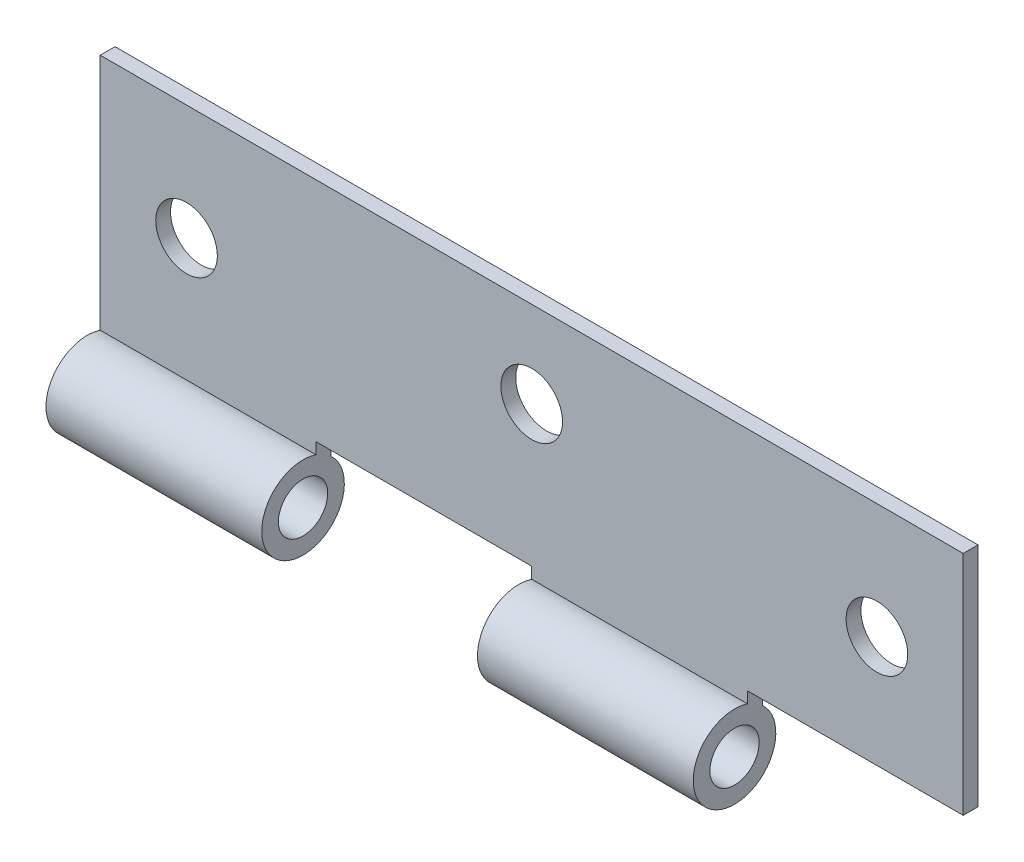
ISO-10303-21;
HEADER;
FILE_DESCRIPTION(('STEP AP214'),'2;1');
FILE_NAME('part.step','',(''),(''),'','','');
FILE_SCHEMA(('AUTOMOTIVE_DESIGN { 1 0 10303 214 1 1 1 1 }'));
ENDSEC;
DATA;
#1=APPLICATION_CONTEXT('core data for automotive mechanical design processes');
#2=APPLICATION_PROTOCOL_DEFINITION('international standard','automotive_design',2000,#1);
#3=PRODUCT_CONTEXT('',#1,'mechanical');
#4=PRODUCT('Part','Part','',(#3));
#5=PRODUCT_RELATED_PRODUCT_CATEGORY('part','',(#4));
#6=PRODUCT_DEFINITION_FORMATION('','',#4);
#7=PRODUCT_DEFINITION_CONTEXT('part definition',#1,'design');
#8=PRODUCT_DEFINITION('design','',#6,#7);
#9=PRODUCT_DEFINITION_SHAPE('','',#8);
#10=(LENGTH_UNIT() NAMED_UNIT(*) SI_UNIT(.MILLI.,.METRE.));
#11=(NAMED_UNIT(*) PLANE_ANGLE_UNIT() SI_UNIT($,.RADIAN.));
#12=(NAMED_UNIT(*) SI_UNIT($,.STERADIAN.) SOLID_ANGLE_UNIT());
#13=UNCERTAINTY_MEASURE_WITH_UNIT(LENGTH_MEASURE(1.E-05),#10,'distance_accuracy_value','');
#14=(GEOMETRIC_REPRESENTATION_CONTEXT(3) GLOBAL_UNCERTAINTY_ASSIGNED_CONTEXT((#13)) GLOBAL_UNIT_ASSIGNED_CONTEXT((#10,
#11,#12)) REPRESENTATION_CONTEXT('',''));
#15=CARTESIAN_POINT('',(0.,0.,0.));
#16=DIRECTION('',(0.,0.,1.));
#17=DIRECTION('',(1.,0.,0.));
#18=AXIS2_PLACEMENT_3D('',#15,#16,#17);
#19=CARTESIAN_POINT('',(35.,3.85,2.25));
#20=DIRECTION('',(-1.,0.,0.));
#21=DIRECTION('',(0.,0.,1.));
#22=AXIS2_PLACEMENT_3D('',#19,#20,#21);
#23=CYLINDRICAL_SURFACE('',#22,3.35);
#24=DIRECTION('',(-1.,0.,0.));
#25=VECTOR('',#24,1.);
#26=CARTESIAN_POINT('',(35.,7.03119474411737,1.2));
#27=LINE('',#26,#25);
#28=CARTESIAN_POINT('',(17.5,7.03119474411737,1.2));
#29=VERTEX_POINT('',#28);
#30=CARTESIAN_POINT('',(0.,7.03119474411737,1.2));
#31=VERTEX_POINT('',#30);
#32=EDGE_CURVE('E179',#29,#31,#27,.T.);
#33=ORIENTED_EDGE('',*,*,#32,.T.);
#34=CARTESIAN_POINT('',(0.,3.85,2.25));
#35=DIRECTION('',(1.,0.,0.));
#36=DIRECTION('',(0.,0.,-1.));
#37=AXIS2_PLACEMENT_3D('',#34,#35,#36);
#38=CIRCLE('',#37,3.35);
#39=CARTESIAN_POINT('',(0.,6.33193472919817,0.));
#40=VERTEX_POINT('',#39);
#41=EDGE_CURVE('E133',#31,#40,#38,.T.);
#42=ORIENTED_EDGE('',*,*,#41,.T.);
#43=DIRECTION('',(-1.,0.,0.));
#44=VECTOR('',#43,1.);
#45=CARTESIAN_POINT('',(35.,6.33193472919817,0.));
#46=LINE('',#45,#44);
#47=CARTESIAN_POINT('',(17.5,6.33193472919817,0.));
#48=VERTEX_POINT('',#47);
#49=EDGE_CURVE('E183',#48,#40,#46,.T.);
#50=ORIENTED_EDGE('',*,*,#49,.F.);
#51=CARTESIAN_POINT('',(17.5,3.85,2.25));
#52=DIRECTION('',(-1.,0.,0.));
#53=DIRECTION('',(0.,-1.,0.));
#54=AXIS2_PLACEMENT_3D('',#51,#52,#53);
#55=CIRCLE('',#54,3.35);
#56=EDGE_CURVE('E143',#48,#29,#55,.T.);
#57=ORIENTED_EDGE('',*,*,#56,.T.);
#58=EDGE_LOOP('',(#33,#42,#50,#57));
#59=FACE_BOUND('',#58,.T.);
#60=ADVANCED_FACE('F34',(#59),#23,.T.);
#61=CARTESIAN_POINT('',(35.,3.85,2.25));
#62=DIRECTION('',(-1.,0.,0.));
#63=DIRECTION('',(0.,0.,1.));
#64=AXIS2_PLACEMENT_3D('',#61,#62,#63);
#65=CYLINDRICAL_SURFACE('',#64,2.);
#66=CARTESIAN_POINT('',(0.,3.85,2.25));
#67=DIRECTION('',(1.,0.,0.));
#68=DIRECTION('',(0.,0.,-1.));
#69=AXIS2_PLACEMENT_3D('',#66,#67,#68);
#70=CIRCLE('',#69,2.);
#71=CARTESIAN_POINT('',(0.,3.85,0.249999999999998));
#72=VERTEX_POINT('',#71);
#73=EDGE_CURVE('E121',#72,#72,#70,.T.);
#74=ORIENTED_EDGE('',*,*,#73,.F.);
#75=EDGE_LOOP('',(#74));
#76=FACE_BOUND('',#75,.T.);
#77=CARTESIAN_POINT('',(17.5,3.85,2.25));
#78=DIRECTION('',(-1.,0.,0.));
#79=DIRECTION('',(0.,-1.,0.));
#80=AXIS2_PLACEMENT_3D('',#77,#78,#79);
#81=CIRCLE('',#80,2.);
#82=CARTESIAN_POINT('',(17.5,1.85,2.25));
#83=VERTEX_POINT('',#82);
#84=EDGE_CURVE('E138',#83,#83,#81,.T.);
#85=ORIENTED_EDGE('',*,*,#84,.F.);
#86=EDGE_LOOP('',(#85));
#87=FACE_BOUND('',#86,.T.);
#88=ADVANCED_FACE('F271',(#76,#87),#65,.F.);
#89=CARTESIAN_POINT('',(35.,3.85,2.25));
#90=DIRECTION('',(1.,0.,0.));
#91=DIRECTION('',(0.,0.,-1.));
#92=AXIS2_PLACEMENT_3D('',#89,#90,#91);
#93=PLANE('',#92);
#94=DIRECTION('',(0.,0.,1.));
#95=VECTOR('',#94,1.);
#96=CARTESIAN_POINT('',(35.,7.95,-1.25));
#97=LINE('',#96,#95);
#98=CARTESIAN_POINT('',(35.,7.95,0.));
#99=VERTEX_POINT('',#98);
#100=CARTESIAN_POINT('',(35.,7.95,1.2));
#101=VERTEX_POINT('',#100);
#102=EDGE_CURVE('E57',#99,#101,#97,.T.);
#103=ORIENTED_EDGE('',*,*,#102,.F.);
#104=DIRECTION('',(0.,-1.,0.));
#105=VECTOR('',#104,1.);
#106=CARTESIAN_POINT('',(35.,6.33193472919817,0.));
#107=LINE('',#106,#105);
#108=CARTESIAN_POINT('',(35.,26.35,0.));
#109=VERTEX_POINT('',#108);
#110=EDGE_CURVE('E155',#109,#99,#107,.T.);
#111=ORIENTED_EDGE('',*,*,#110,.F.);
#112=DIRECTION('',(0.,0.,-1.));
#113=VECTOR('',#112,1.);
#114=CARTESIAN_POINT('',(35.,26.35,1.2));
#115=LINE('',#114,#113);
#116=CARTESIAN_POINT('',(35.,26.35,1.2));
#117=VERTEX_POINT('',#116);
#118=EDGE_CURVE('E161',#117,#109,#115,.T.);
#119=ORIENTED_EDGE('',*,*,#118,.F.);
#120=DIRECTION('',(0.,1.,0.));
#121=VECTOR('',#120,1.);
#122=CARTESIAN_POINT('',(35.,7.03119474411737,1.2));
#123=LINE('',#122,#121);
#124=EDGE_CURVE('E158',#101,#117,#123,.T.);
#125=ORIENTED_EDGE('',*,*,#124,.F.);
#126=EDGE_LOOP('',(#103,#111,#119,#125));
#127=FACE_BOUND('',#126,.T.);
#128=ADVANCED_FACE('F249',(#127),#93,.T.);
#129=CARTESIAN_POINT('',(-35.,3.85,2.25));
#130=DIRECTION('',(1.,0.,0.));
#131=DIRECTION('',(0.,0.,-1.));
#132=AXIS2_PLACEMENT_3D('',#129,#130,#131);
#133=PLANE('',#132);
#134=DIRECTION('',(0.,-1.,0.));
#135=VECTOR('',#134,1.);
#136=CARTESIAN_POINT('',(-35.,6.33193472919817,0.));
#137=LINE('',#136,#135);
#138=CARTESIAN_POINT('',(-35.,26.35,0.));
#139=VERTEX_POINT('',#138);
#140=CARTESIAN_POINT('',(-35.,6.33193472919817,0.));
#141=VERTEX_POINT('',#140);
#142=EDGE_CURVE('E154',#139,#141,#137,.T.);
#143=ORIENTED_EDGE('',*,*,#142,.T.);
#144=CARTESIAN_POINT('',(-35.,3.85,2.25));
#145=DIRECTION('',(-1.,0.,0.));
#146=DIRECTION('',(0.,0.,-1.));
#147=AXIS2_PLACEMENT_3D('',#144,#145,#146);
#148=CIRCLE('',#147,3.35);
#149=CARTESIAN_POINT('',(-35.,7.03119474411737,1.2));
#150=VERTEX_POINT('',#149);
#151=EDGE_CURVE('E167',#141,#150,#148,.T.);
#152=ORIENTED_EDGE('',*,*,#151,.T.);
#153=DIRECTION('',(0.,1.,0.));
#154=VECTOR('',#153,1.);
#155=CARTESIAN_POINT('',(-35.,7.03119474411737,1.2));
#156=LINE('',#155,#154);
#157=CARTESIAN_POINT('',(-35.,26.35,1.2));
#158=VERTEX_POINT('',#157);
#159=EDGE_CURVE('E170',#150,#158,#156,.T.);
#160=ORIENTED_EDGE('',*,*,#159,.T.);
#161=DIRECTION('',(0.,0.,-1.));
#162=VECTOR('',#161,1.);
#163=CARTESIAN_POINT('',(-35.,26.35,1.2));
#164=LINE('',#163,#162);
#165=EDGE_CURVE('E159',#158,#139,#164,.T.);
#166=ORIENTED_EDGE('',*,*,#165,.T.);
#167=EDGE_LOOP('',(#143,#152,#160,#166));
#168=FACE_BOUND('',#167,.T.);
#169=CARTESIAN_POINT('',(-35.,3.85,2.25));
#170=DIRECTION('',(-1.,0.,0.));
#171=DIRECTION('',(0.,0.,-1.));
#172=AXIS2_PLACEMENT_3D('',#169,#170,#171);
#173=CIRCLE('',#172,2.);
#174=CARTESIAN_POINT('',(-35.,3.85,0.249999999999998));
#175=VERTEX_POINT('',#174);
#176=EDGE_CURVE('E151',#175,#175,#173,.T.);
#177=ORIENTED_EDGE('',*,*,#176,.F.);
#178=EDGE_LOOP('',(#177));
#179=FACE_BOUND('',#178,.T.);
#180=ADVANCED_FACE('F240',(#168,#179),#133,.F.);
#181=CARTESIAN_POINT('',(35.,6.33193472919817,0.));
#182=DIRECTION('',(0.,0.,1.));
#183=DIRECTION('',(1.,0.,0.));
#184=AXIS2_PLACEMENT_3D('',#181,#182,#183);
#185=PLANE('',#184);
#186=CARTESIAN_POINT('',(0.,19.35,0.));
#187=DIRECTION('',(0.,0.,1.));
#188=DIRECTION('',(1.,0.,0.));
#189=AXIS2_PLACEMENT_3D('',#186,#187,#188);
#190=CIRCLE('',#189,2.5);
#191=CARTESIAN_POINT('',(2.5,19.35,0.));
#192=VERTEX_POINT('',#191);
#193=EDGE_CURVE('E202',#192,#192,#190,.T.);
#194=ORIENTED_EDGE('',*,*,#193,.T.);
#195=EDGE_LOOP('',(#194));
#196=FACE_BOUND('',#195,.T.);
#197=CARTESIAN_POINT('',(28.,17.,0.));
#198=DIRECTION('',(0.,0.,1.));
#199=DIRECTION('',(1.,0.,0.));
#200=AXIS2_PLACEMENT_3D('',#197,#198,#199);
#201=CIRCLE('',#200,2.5);
#202=CARTESIAN_POINT('',(30.5,17.,0.));
#203=VERTEX_POINT('',#202);
#204=EDGE_CURVE('E206',#203,#203,#201,.T.);
#205=ORIENTED_EDGE('',*,*,#204,.T.);
#206=EDGE_LOOP('',(#205));
#207=FACE_BOUND('',#206,.T.);
#208=CARTESIAN_POINT('',(-28.,17.,0.));
#209=DIRECTION('',(0.,0.,1.));
#210=DIRECTION('',(1.,0.,0.));
#211=AXIS2_PLACEMENT_3D('',#208,#209,#210);
#212=CIRCLE('',#211,2.5);
#213=CARTESIAN_POINT('',(-25.5,17.,0.));
#214=VERTEX_POINT('',#213);
#215=EDGE_CURVE('E209',#214,#214,#212,.T.);
#216=ORIENTED_EDGE('',*,*,#215,.T.);
#217=EDGE_LOOP('',(#216));
#218=FACE_BOUND('',#217,.T.);
#219=ORIENTED_EDGE('',*,*,#49,.T.);
#220=DIRECTION('',(0.,1.,0.));
#221=VECTOR('',#220,1.);
#222=CARTESIAN_POINT('',(0.,6.33193472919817,0.));
#223=LINE('',#222,#221);
#224=CARTESIAN_POINT('',(0.,7.95,0.));
#225=VERTEX_POINT('',#224);
#226=EDGE_CURVE('E129',#40,#225,#223,.T.);
#227=ORIENTED_EDGE('',*,*,#226,.T.);
#228=DIRECTION('',(-1.,0.,0.));
#229=VECTOR('',#228,1.);
#230=CARTESIAN_POINT('',(35.,7.95000000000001,0.));
#231=LINE('',#230,#229);
#232=CARTESIAN_POINT('',(-17.5,7.94999999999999,0.));
#233=VERTEX_POINT('',#232);
#234=EDGE_CURVE('E124',#225,#233,#231,.T.);
#235=ORIENTED_EDGE('',*,*,#234,.T.);
#236=DIRECTION('',(0.,-1.,0.));
#237=VECTOR('',#236,1.);
#238=CARTESIAN_POINT('',(-17.5,6.33193472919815,0.));
#239=LINE('',#238,#237);
#240=CARTESIAN_POINT('',(-17.5,6.33193472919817,0.));
#241=VERTEX_POINT('',#240);
#242=EDGE_CURVE('E111',#233,#241,#239,.T.);
#243=ORIENTED_EDGE('',*,*,#242,.T.);
#244=EDGE_CURVE('E182',#241,#141,#46,.T.);
#245=ORIENTED_EDGE('',*,*,#244,.T.);
#246=ORIENTED_EDGE('',*,*,#142,.F.);
#247=DIRECTION('',(-1.,0.,0.));
#248=VECTOR('',#247,1.);
#249=CARTESIAN_POINT('',(35.,26.35,0.));
#250=LINE('',#249,#248);
#251=EDGE_CURVE('E164',#109,#139,#250,.T.);
#252=ORIENTED_EDGE('',*,*,#251,.F.);
#253=ORIENTED_EDGE('',*,*,#110,.T.);
#254=DIRECTION('',(-1.,0.,0.));
#255=VECTOR('',#254,1.);
#256=CARTESIAN_POINT('',(35.,7.95,0.));
#257=LINE('',#256,#255);
#258=CARTESIAN_POINT('',(17.5,7.94999999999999,0.));
#259=VERTEX_POINT('',#258);
#260=EDGE_CURVE('E148',#99,#259,#257,.T.);
#261=ORIENTED_EDGE('',*,*,#260,.T.);
#262=DIRECTION('',(0.,-1.,0.));
#263=VECTOR('',#262,1.);
#264=CARTESIAN_POINT('',(17.5,6.33193472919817,0.));
#265=LINE('',#264,#263);
#266=EDGE_CURVE('E145',#259,#48,#265,.T.);
#267=ORIENTED_EDGE('',*,*,#266,.T.);
#268=EDGE_LOOP('',(#219,#227,#235,#243,#245,#246,#252,#253,#261,#267));
#269=FACE_BOUND('',#268,.T.);
#270=ADVANCED_FACE('F36',(#196,#207,#218,#269),#185,.F.);
#271=CARTESIAN_POINT('',(-17.5,3.85,2.25));
#272=DIRECTION('',(-1.,0.,0.));
#273=DIRECTION('',(0.,-1.,0.));
#274=AXIS2_PLACEMENT_3D('',#271,#272,#273);
#275=CIRCLE('',#274,3.35);
#276=CARTESIAN_POINT('',(-17.5,7.03119474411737,1.2));
#277=VERTEX_POINT('',#276);
#278=EDGE_CURVE('E117',#241,#277,#275,.T.);
#279=ORIENTED_EDGE('',*,*,#278,.T.);
#280=EDGE_CURVE('E178',#277,#150,#27,.T.);
#281=ORIENTED_EDGE('',*,*,#280,.T.);
#282=ORIENTED_EDGE('',*,*,#151,.F.);
#283=ORIENTED_EDGE('',*,*,#244,.F.);
#284=EDGE_LOOP('',(#279,#281,#282,#283));
#285=FACE_BOUND('',#284,.T.);
#286=ADVANCED_FACE('F229',(#285),#23,.T.);
#287=CARTESIAN_POINT('',(35.,7.03119474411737,1.2));
#288=DIRECTION('',(0.,0.,-1.));
#289=DIRECTION('',(0.,-1.,0.));
#290=AXIS2_PLACEMENT_3D('',#287,#288,#289);
#291=PLANE('',#290);
#292=CARTESIAN_POINT('',(0.,19.35,1.2));
#293=DIRECTION('',(0.,0.,1.));
#294=DIRECTION('',(-1.,0.,0.));
#295=AXIS2_PLACEMENT_3D('',#292,#293,#294);
#296=CIRCLE('',#295,2.5);
#297=CARTESIAN_POINT('',(-2.5,19.35,1.2));
#298=VERTEX_POINT('',#297);
#299=EDGE_CURVE('E212',#298,#298,#296,.T.);
#300=ORIENTED_EDGE('',*,*,#299,.F.);
#301=EDGE_LOOP('',(#300));
#302=FACE_BOUND('',#301,.T.);
#303=CARTESIAN_POINT('',(28.,17.,1.2));
#304=DIRECTION('',(0.,0.,1.));
#305=DIRECTION('',(1.,0.,0.));
#306=AXIS2_PLACEMENT_3D('',#303,#304,#305);
#307=CIRCLE('',#306,2.5);
#308=CARTESIAN_POINT('',(30.5,17.,1.2));
#309=VERTEX_POINT('',#308);
#310=EDGE_CURVE('E216',#309,#309,#307,.T.);
#311=ORIENTED_EDGE('',*,*,#310,.F.);
#312=EDGE_LOOP('',(#311));
#313=FACE_BOUND('',#312,.T.);
#314=CARTESIAN_POINT('',(-28.,17.,1.2));
#315=DIRECTION('',(0.,0.,1.));
#316=DIRECTION('',(-1.,0.,0.));
#317=AXIS2_PLACEMENT_3D('',#314,#315,#316);
#318=CIRCLE('',#317,2.5);
#319=CARTESIAN_POINT('',(-30.5,17.,1.2));
#320=VERTEX_POINT('',#319);
#321=EDGE_CURVE('E213',#320,#320,#318,.T.);
#322=ORIENTED_EDGE('',*,*,#321,.F.);
#323=EDGE_LOOP('',(#322));
#324=FACE_BOUND('',#323,.T.);
#325=DIRECTION('',(1.,0.,0.));
#326=VECTOR('',#325,1.);
#327=CARTESIAN_POINT('',(35.,7.95000000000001,1.2));
#328=LINE('',#327,#326);
#329=CARTESIAN_POINT('',(-17.5,7.94999999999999,1.2));
#330=VERTEX_POINT('',#329);
#331=CARTESIAN_POINT('',(0.,7.95,1.2));
#332=VERTEX_POINT('',#331);
#333=EDGE_CURVE('E12',#330,#332,#328,.T.);
#334=ORIENTED_EDGE('',*,*,#333,.T.);
#335=DIRECTION('',(0.,-1.,0.));
#336=VECTOR('',#335,1.);
#337=CARTESIAN_POINT('',(0.,7.03119474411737,1.2));
#338=LINE('',#337,#336);
#339=EDGE_CURVE('E191',#332,#31,#338,.T.);
#340=ORIENTED_EDGE('',*,*,#339,.T.);
#341=ORIENTED_EDGE('',*,*,#32,.F.);
#342=DIRECTION('',(0.,1.,0.));
#343=VECTOR('',#342,1.);
#344=CARTESIAN_POINT('',(17.5,7.03119474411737,1.2));
#345=LINE('',#344,#343);
#346=CARTESIAN_POINT('',(17.5,7.94999999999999,1.2));
#347=VERTEX_POINT('',#346);
#348=EDGE_CURVE('E140',#29,#347,#345,.T.);
#349=ORIENTED_EDGE('',*,*,#348,.T.);
#350=DIRECTION('',(1.,0.,0.));
#351=VECTOR('',#350,1.);
#352=CARTESIAN_POINT('',(35.,7.95,1.2));
#353=LINE('',#352,#351);
#354=EDGE_CURVE('E42',#347,#101,#353,.T.);
#355=ORIENTED_EDGE('',*,*,#354,.T.);
#356=ORIENTED_EDGE('',*,*,#124,.T.);
#357=DIRECTION('',(-1.,0.,0.));
#358=VECTOR('',#357,1.);
#359=CARTESIAN_POINT('',(35.,26.35,1.2));
#360=LINE('',#359,#358);
#361=EDGE_CURVE('E176',#117,#158,#360,.T.);
#362=ORIENTED_EDGE('',*,*,#361,.T.);
#363=ORIENTED_EDGE('',*,*,#159,.F.);
#364=ORIENTED_EDGE('',*,*,#280,.F.);
#365=DIRECTION('',(0.,1.,0.));
#366=VECTOR('',#365,1.);
#367=CARTESIAN_POINT('',(-17.5,7.03119474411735,1.2));
#368=LINE('',#367,#366);
#369=EDGE_CURVE('E189',#277,#330,#368,.T.);
#370=ORIENTED_EDGE('',*,*,#369,.T.);
#371=EDGE_LOOP('',(#334,#340,#341,#349,#355,#356,#362,#363,#364,#370));
#372=FACE_BOUND('',#371,.T.);
#373=ADVANCED_FACE('F225',(#302,#313,#324,#372),#291,.F.);
#374=CARTESIAN_POINT('',(35.,26.35,1.2));
#375=DIRECTION('',(0.,-1.,0.));
#376=DIRECTION('',(0.,0.,1.));
#377=AXIS2_PLACEMENT_3D('',#374,#375,#376);
#378=PLANE('',#377);
#379=ORIENTED_EDGE('',*,*,#165,.F.);
#380=ORIENTED_EDGE('',*,*,#361,.F.);
#381=ORIENTED_EDGE('',*,*,#118,.T.);
#382=ORIENTED_EDGE('',*,*,#251,.T.);
#383=EDGE_LOOP('',(#379,#380,#381,#382));
#384=FACE_BOUND('',#383,.T.);
#385=ADVANCED_FACE('F228',(#384),#378,.F.);
#386=CARTESIAN_POINT('',(-17.5,3.85,2.25));
#387=DIRECTION('',(-1.,0.,0.));
#388=DIRECTION('',(0.,-1.,0.));
#389=AXIS2_PLACEMENT_3D('',#386,#387,#388);
#390=CIRCLE('',#389,2.);
#391=CARTESIAN_POINT('',(-17.5,1.85,2.25));
#392=VERTEX_POINT('',#391);
#393=EDGE_CURVE('E125',#392,#392,#390,.T.);
#394=ORIENTED_EDGE('',*,*,#393,.F.);
#395=EDGE_LOOP('',(#394));
#396=FACE_BOUND('',#395,.T.);
#397=ORIENTED_EDGE('',*,*,#176,.T.);
#398=EDGE_LOOP('',(#397));
#399=FACE_BOUND('',#398,.T.);
#400=ADVANCED_FACE('F277',(#396,#399),#65,.F.);
#401=CARTESIAN_POINT('',(35.,7.95,-1.25));
#402=DIRECTION('',(0.,1.,0.));
#403=DIRECTION('',(-1.,0.,0.));
#404=AXIS2_PLACEMENT_3D('',#401,#402,#403);
#405=PLANE('',#404);
#406=ORIENTED_EDGE('',*,*,#102,.T.);
#407=ORIENTED_EDGE('',*,*,#354,.F.);
#408=DIRECTION('',(0.,0.,1.));
#409=VECTOR('',#408,1.);
#410=CARTESIAN_POINT('',(17.5,7.94999999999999,-1.25));
#411=LINE('',#410,#409);
#412=EDGE_CURVE('E131',#259,#347,#411,.T.);
#413=ORIENTED_EDGE('',*,*,#412,.F.);
#414=ORIENTED_EDGE('',*,*,#260,.F.);
#415=EDGE_LOOP('',(#406,#407,#413,#414));
#416=FACE_BOUND('',#415,.T.);
#417=ADVANCED_FACE('F252',(#416),#405,.F.);
#418=CARTESIAN_POINT('',(17.5,7.94999999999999,-1.25));
#419=DIRECTION('',(-1.,0.,0.));
#420=DIRECTION('',(0.,-1.,0.));
#421=AXIS2_PLACEMENT_3D('',#418,#419,#420);
#422=PLANE('',#421);
#423=ORIENTED_EDGE('',*,*,#84,.T.);
#424=EDGE_LOOP('',(#423));
#425=FACE_BOUND('',#424,.T.);
#426=ORIENTED_EDGE('',*,*,#412,.T.);
#427=ORIENTED_EDGE('',*,*,#348,.F.);
#428=ORIENTED_EDGE('',*,*,#56,.F.);
#429=ORIENTED_EDGE('',*,*,#266,.F.);
#430=EDGE_LOOP('',(#426,#427,#428,#429));
#431=FACE_BOUND('',#430,.T.);
#432=ADVANCED_FACE('F255',(#425,#431),#422,.F.);
#433=CARTESIAN_POINT('',(0.,7.95,-1.25));
#434=DIRECTION('',(0.,1.,0.));
#435=DIRECTION('',(-1.,0.,0.));
#436=AXIS2_PLACEMENT_3D('',#433,#434,#435);
#437=PLANE('',#436);
#438=DIRECTION('',(0.,0.,1.));
#439=VECTOR('',#438,1.);
#440=CARTESIAN_POINT('',(0.,7.95,-1.25));
#441=LINE('',#440,#439);
#442=EDGE_CURVE('E49',#225,#332,#441,.T.);
#443=ORIENTED_EDGE('',*,*,#442,.T.);
#444=ORIENTED_EDGE('',*,*,#333,.F.);
#445=DIRECTION('',(0.,0.,1.));
#446=VECTOR('',#445,1.);
#447=CARTESIAN_POINT('',(-17.5,7.94999999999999,-1.25));
#448=LINE('',#447,#446);
#449=EDGE_CURVE('E115',#233,#330,#448,.T.);
#450=ORIENTED_EDGE('',*,*,#449,.F.);
#451=ORIENTED_EDGE('',*,*,#234,.F.);
#452=EDGE_LOOP('',(#443,#444,#450,#451));
#453=FACE_BOUND('',#452,.T.);
#454=ADVANCED_FACE('F123',(#453),#437,.F.);
#455=CARTESIAN_POINT('',(0.,7.95,-1.25));
#456=DIRECTION('',(1.,0.,0.));
#457=DIRECTION('',(0.,0.,-1.));
#458=AXIS2_PLACEMENT_3D('',#455,#456,#457);
#459=PLANE('',#458);
#460=ORIENTED_EDGE('',*,*,#73,.T.);
#461=EDGE_LOOP('',(#460));
#462=FACE_BOUND('',#461,.T.);
#463=ORIENTED_EDGE('',*,*,#41,.F.);
#464=ORIENTED_EDGE('',*,*,#339,.F.);
#465=ORIENTED_EDGE('',*,*,#442,.F.);
#466=ORIENTED_EDGE('',*,*,#226,.F.);
#467=EDGE_LOOP('',(#463,#464,#465,#466));
#468=FACE_BOUND('',#467,.T.);
#469=ADVANCED_FACE('F258',(#462,#468),#459,.F.);
#470=CARTESIAN_POINT('',(-17.5,7.94999999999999,-1.25));
#471=DIRECTION('',(-1.,0.,0.));
#472=DIRECTION('',(0.,-1.,0.));
#473=AXIS2_PLACEMENT_3D('',#470,#471,#472);
#474=PLANE('',#473);
#475=ORIENTED_EDGE('',*,*,#393,.T.);
#476=EDGE_LOOP('',(#475));
#477=FACE_BOUND('',#476,.T.);
#478=ORIENTED_EDGE('',*,*,#449,.T.);
#479=ORIENTED_EDGE('',*,*,#369,.F.);
#480=ORIENTED_EDGE('',*,*,#278,.F.);
#481=ORIENTED_EDGE('',*,*,#242,.F.);
#482=EDGE_LOOP('',(#478,#479,#480,#481));
#483=FACE_BOUND('',#482,.T.);
#484=ADVANCED_FACE('F113',(#477,#483),#474,.F.);
#485=CARTESIAN_POINT('',(-28.,17.,-1.25));
#486=DIRECTION('',(0.,0.,1.));
#487=DIRECTION('',(1.,0.,0.));
#488=AXIS2_PLACEMENT_3D('',#485,#486,#487);
#489=CYLINDRICAL_SURFACE('',#488,2.5);
#490=ORIENTED_EDGE('',*,*,#321,.T.);
#491=EDGE_LOOP('',(#490));
#492=FACE_BOUND('',#491,.T.);
#493=ORIENTED_EDGE('',*,*,#215,.F.);
#494=EDGE_LOOP('',(#493));
#495=FACE_BOUND('',#494,.T.);
#496=ADVANCED_FACE('F265',(#492,#495),#489,.F.);
#497=CARTESIAN_POINT('',(28.,17.,-1.25));
#498=DIRECTION('',(0.,0.,1.));
#499=DIRECTION('',(1.,0.,0.));
#500=AXIS2_PLACEMENT_3D('',#497,#498,#499);
#501=CYLINDRICAL_SURFACE('',#500,2.5);
#502=ORIENTED_EDGE('',*,*,#310,.T.);
#503=EDGE_LOOP('',(#502));
#504=FACE_BOUND('',#503,.T.);
#505=ORIENTED_EDGE('',*,*,#204,.F.);
#506=EDGE_LOOP('',(#505));
#507=FACE_BOUND('',#506,.T.);
#508=ADVANCED_FACE('F294',(#504,#507),#501,.F.);
#509=CARTESIAN_POINT('',(0.,19.35,-1.25));
#510=DIRECTION('',(0.,0.,1.));
#511=DIRECTION('',(1.,0.,0.));
#512=AXIS2_PLACEMENT_3D('',#509,#510,#511);
#513=CYLINDRICAL_SURFACE('',#512,2.5);
#514=ORIENTED_EDGE('',*,*,#299,.T.);
#515=EDGE_LOOP('',(#514));
#516=FACE_BOUND('',#515,.T.);
#517=ORIENTED_EDGE('',*,*,#193,.F.);
#518=EDGE_LOOP('',(#517));
#519=FACE_BOUND('',#518,.T.);
#520=ADVANCED_FACE('F222',(#516,#519),#513,.F.);
#521=CLOSED_SHELL('',(#60,#88,#128,#180,#270,#286,#373,#385,#400,#417,#432,#454,#469,#484,#496,
#508,#520));
#522=MANIFOLD_SOLID_BREP('B2',#521);
#523=ADVANCED_BREP_SHAPE_REPRESENTATION('',(#18,#522),#14);
#524=SHAPE_DEFINITION_REPRESENTATION(#9,#523);
ENDSEC;
END-ISO-10303-21;
